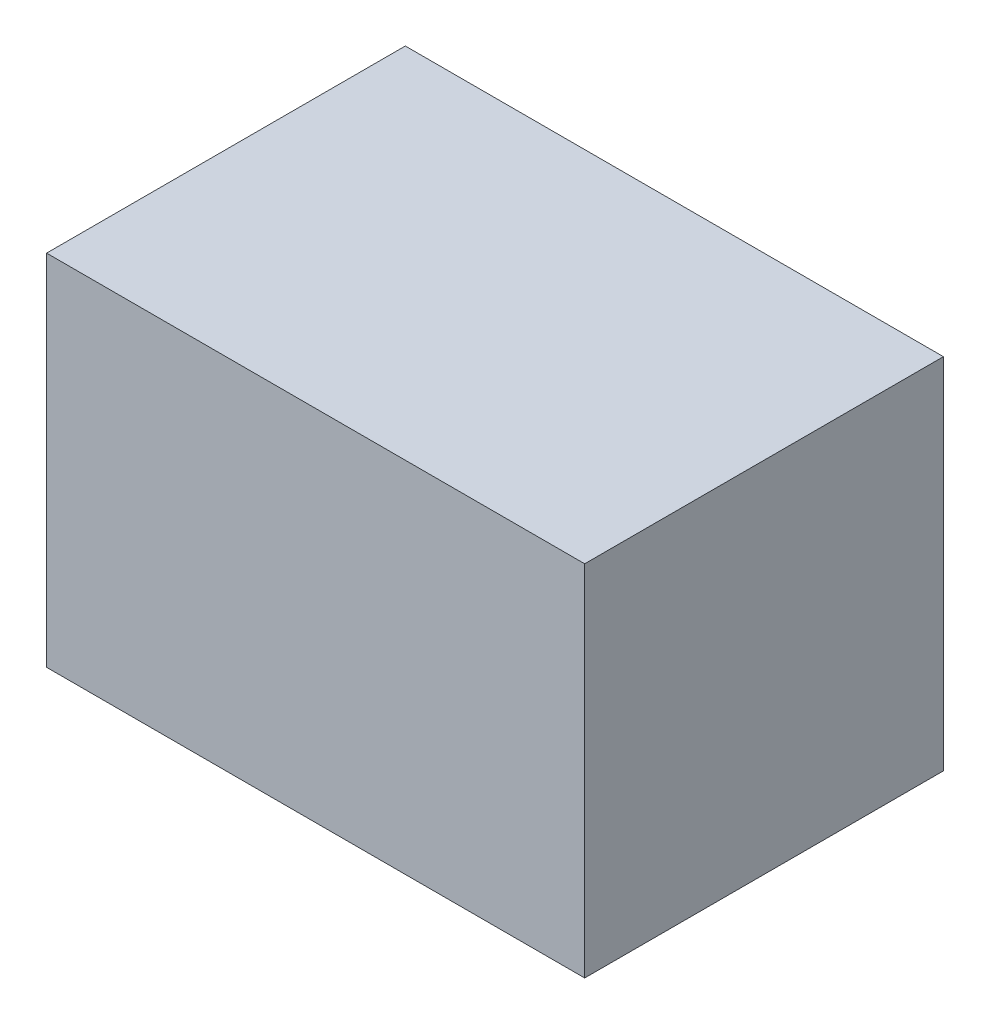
ISO-10303-21;
HEADER;
FILE_DESCRIPTION(('STEP AP214'),'2;1');
FILE_NAME('part.step','',(''),(''),'','','');
FILE_SCHEMA(('AUTOMOTIVE_DESIGN { 1 0 10303 214 1 1 1 1 }'));
ENDSEC;
DATA;
#1=APPLICATION_CONTEXT('core data for automotive mechanical design processes');
#2=APPLICATION_PROTOCOL_DEFINITION('international standard','automotive_design',2000,#1);
#3=PRODUCT_CONTEXT('',#1,'mechanical');
#4=PRODUCT('Part','Part','',(#3));
#5=PRODUCT_RELATED_PRODUCT_CATEGORY('part','',(#4));
#6=PRODUCT_DEFINITION_FORMATION('','',#4);
#7=PRODUCT_DEFINITION_CONTEXT('part definition',#1,'design');
#8=PRODUCT_DEFINITION('design','',#6,#7);
#9=PRODUCT_DEFINITION_SHAPE('','',#8);
#10=(LENGTH_UNIT() NAMED_UNIT(*) SI_UNIT(.MILLI.,.METRE.));
#11=(NAMED_UNIT(*) PLANE_ANGLE_UNIT() SI_UNIT($,.RADIAN.));
#12=(NAMED_UNIT(*) SI_UNIT($,.STERADIAN.) SOLID_ANGLE_UNIT());
#13=UNCERTAINTY_MEASURE_WITH_UNIT(LENGTH_MEASURE(1.E-05),#10,'distance_accuracy_value','');
#14=(GEOMETRIC_REPRESENTATION_CONTEXT(3) GLOBAL_UNCERTAINTY_ASSIGNED_CONTEXT((#13)) GLOBAL_UNIT_ASSIGNED_CONTEXT((#10,
#11,#12)) REPRESENTATION_CONTEXT('',''));
#15=CARTESIAN_POINT('',(0.,0.,0.));
#16=DIRECTION('',(0.,0.,1.));
#17=DIRECTION('',(1.,0.,0.));
#18=AXIS2_PLACEMENT_3D('',#15,#16,#17);
#19=CARTESIAN_POINT('',(0.,10.,0.));
#20=DIRECTION('',(1.,0.,0.));
#21=DIRECTION('',(0.,0.,-1.));
#22=AXIS2_PLACEMENT_3D('',#19,#20,#21);
#23=PLANE('',#22);
#24=DIRECTION('',(0.,0.,1.));
#25=VECTOR('',#24,1.);
#26=CARTESIAN_POINT('',(0.,0.,0.));
#27=LINE('',#26,#25);
#28=CARTESIAN_POINT('',(0.,0.,-10.));
#29=VERTEX_POINT('',#28);
#30=CARTESIAN_POINT('',(0.,0.,0.));
#31=VERTEX_POINT('',#30);
#32=EDGE_CURVE('E104',#29,#31,#27,.T.);
#33=ORIENTED_EDGE('',*,*,#32,.T.);
#34=DIRECTION('',(0.,-1.,0.));
#35=VECTOR('',#34,1.);
#36=CARTESIAN_POINT('',(0.,10.,0.));
#37=LINE('',#36,#35);
#38=CARTESIAN_POINT('',(0.,10.,0.));
#39=VERTEX_POINT('',#38);
#40=EDGE_CURVE('E11',#39,#31,#37,.T.);
#41=ORIENTED_EDGE('',*,*,#40,.F.);
#42=DIRECTION('',(0.,0.,1.));
#43=VECTOR('',#42,1.);
#44=CARTESIAN_POINT('',(0.,10.,0.));
#45=LINE('',#44,#43);
#46=CARTESIAN_POINT('',(0.,10.,-10.));
#47=VERTEX_POINT('',#46);
#48=EDGE_CURVE('E92',#47,#39,#45,.T.);
#49=ORIENTED_EDGE('',*,*,#48,.F.);
#50=DIRECTION('',(0.,-1.,0.));
#51=VECTOR('',#50,1.);
#52=CARTESIAN_POINT('',(0.,10.,-10.));
#53=LINE('',#52,#51);
#54=EDGE_CURVE('E100',#47,#29,#53,.T.);
#55=ORIENTED_EDGE('',*,*,#54,.T.);
#56=EDGE_LOOP('',(#33,#41,#49,#55));
#57=FACE_BOUND('',#56,.T.);
#58=ADVANCED_FACE('F41',(#57),#23,.F.);
#59=CARTESIAN_POINT('',(0.,10.,0.));
#60=DIRECTION('',(0.,0.,-1.));
#61=DIRECTION('',(-1.,0.,0.));
#62=AXIS2_PLACEMENT_3D('',#59,#60,#61);
#63=PLANE('',#62);
#64=DIRECTION('',(1.,0.,0.));
#65=VECTOR('',#64,1.);
#66=CARTESIAN_POINT('',(0.,0.,0.));
#67=LINE('',#66,#65);
#68=CARTESIAN_POINT('',(15.,0.,0.));
#69=VERTEX_POINT('',#68);
#70=EDGE_CURVE('E96',#31,#69,#67,.T.);
#71=ORIENTED_EDGE('',*,*,#70,.T.);
#72=DIRECTION('',(0.,-1.,0.));
#73=VECTOR('',#72,1.);
#74=CARTESIAN_POINT('',(15.,10.,0.));
#75=LINE('',#74,#73);
#76=CARTESIAN_POINT('',(15.,10.,0.));
#77=VERTEX_POINT('',#76);
#78=EDGE_CURVE('E49',#77,#69,#75,.T.);
#79=ORIENTED_EDGE('',*,*,#78,.F.);
#80=DIRECTION('',(1.,0.,0.));
#81=VECTOR('',#80,1.);
#82=CARTESIAN_POINT('',(0.,10.,0.));
#83=LINE('',#82,#81);
#84=EDGE_CURVE('E87',#39,#77,#83,.T.);
#85=ORIENTED_EDGE('',*,*,#84,.F.);
#86=ORIENTED_EDGE('',*,*,#40,.T.);
#87=EDGE_LOOP('',(#71,#79,#85,#86));
#88=FACE_BOUND('',#87,.T.);
#89=ADVANCED_FACE('F95',(#88),#63,.F.);
#90=CARTESIAN_POINT('',(15.,10.,0.));
#91=DIRECTION('',(-1.,0.,0.));
#92=DIRECTION('',(0.,0.,1.));
#93=AXIS2_PLACEMENT_3D('',#90,#91,#92);
#94=PLANE('',#93);
#95=DIRECTION('',(0.,0.,-1.));
#96=VECTOR('',#95,1.);
#97=CARTESIAN_POINT('',(15.,0.,0.));
#98=LINE('',#97,#96);
#99=CARTESIAN_POINT('',(15.,0.,-10.));
#100=VERTEX_POINT('',#99);
#101=EDGE_CURVE('E74',#69,#100,#98,.T.);
#102=ORIENTED_EDGE('',*,*,#101,.T.);
#103=DIRECTION('',(0.,-1.,0.));
#104=VECTOR('',#103,1.);
#105=CARTESIAN_POINT('',(15.,10.,-10.));
#106=LINE('',#105,#104);
#107=CARTESIAN_POINT('',(15.,10.,-10.));
#108=VERTEX_POINT('',#107);
#109=EDGE_CURVE('E97',#108,#100,#106,.T.);
#110=ORIENTED_EDGE('',*,*,#109,.F.);
#111=DIRECTION('',(0.,0.,-1.));
#112=VECTOR('',#111,1.);
#113=CARTESIAN_POINT('',(15.,10.,0.));
#114=LINE('',#113,#112);
#115=EDGE_CURVE('E90',#77,#108,#114,.T.);
#116=ORIENTED_EDGE('',*,*,#115,.F.);
#117=ORIENTED_EDGE('',*,*,#78,.T.);
#118=EDGE_LOOP('',(#102,#110,#116,#117));
#119=FACE_BOUND('',#118,.T.);
#120=ADVANCED_FACE('F98',(#119),#94,.F.);
#121=CARTESIAN_POINT('',(0.,10.,-10.));
#122=DIRECTION('',(0.,0.,1.));
#123=DIRECTION('',(1.,0.,0.));
#124=AXIS2_PLACEMENT_3D('',#121,#122,#123);
#125=PLANE('',#124);
#126=DIRECTION('',(-1.,0.,0.));
#127=VECTOR('',#126,1.);
#128=CARTESIAN_POINT('',(0.,0.,-10.));
#129=LINE('',#128,#127);
#130=EDGE_CURVE('E80',#100,#29,#129,.T.);
#131=ORIENTED_EDGE('',*,*,#130,.T.);
#132=ORIENTED_EDGE('',*,*,#54,.F.);
#133=DIRECTION('',(-1.,0.,0.));
#134=VECTOR('',#133,1.);
#135=CARTESIAN_POINT('',(0.,10.,-10.));
#136=LINE('',#135,#134);
#137=EDGE_CURVE('E57',#108,#47,#136,.T.);
#138=ORIENTED_EDGE('',*,*,#137,.F.);
#139=ORIENTED_EDGE('',*,*,#109,.T.);
#140=EDGE_LOOP('',(#131,#132,#138,#139));
#141=FACE_BOUND('',#140,.T.);
#142=ADVANCED_FACE('F111',(#141),#125,.F.);
#143=CARTESIAN_POINT('',(0.,10.,0.));
#144=DIRECTION('',(0.,-1.,0.));
#145=DIRECTION('',(0.,0.,-1.));
#146=AXIS2_PLACEMENT_3D('',#143,#144,#145);
#147=PLANE('',#146);
#148=ORIENTED_EDGE('',*,*,#48,.T.);
#149=ORIENTED_EDGE('',*,*,#84,.T.);
#150=ORIENTED_EDGE('',*,*,#115,.T.);
#151=ORIENTED_EDGE('',*,*,#137,.T.);
#152=EDGE_LOOP('',(#148,#149,#150,#151));
#153=FACE_BOUND('',#152,.T.);
#154=ADVANCED_FACE('F88',(#153),#147,.F.);
#155=CARTESIAN_POINT('',(0.,0.,0.));
#156=DIRECTION('',(0.,-1.,0.));
#157=DIRECTION('',(0.,0.,-1.));
#158=AXIS2_PLACEMENT_3D('',#155,#156,#157);
#159=PLANE('',#158);
#160=ORIENTED_EDGE('',*,*,#32,.F.);
#161=ORIENTED_EDGE('',*,*,#130,.F.);
#162=ORIENTED_EDGE('',*,*,#101,.F.);
#163=ORIENTED_EDGE('',*,*,#70,.F.);
#164=EDGE_LOOP('',(#160,#161,#162,#163));
#165=FACE_BOUND('',#164,.T.);
#166=ADVANCED_FACE('F114',(#165),#159,.T.);
#167=CLOSED_SHELL('',(#58,#89,#120,#142,#154,#166));
#168=MANIFOLD_SOLID_BREP('B2',#167);
#169=ADVANCED_BREP_SHAPE_REPRESENTATION('',(#18,#168),#14);
#170=SHAPE_DEFINITION_REPRESENTATION(#9,#169);
ENDSEC;
END-ISO-10303-21;
